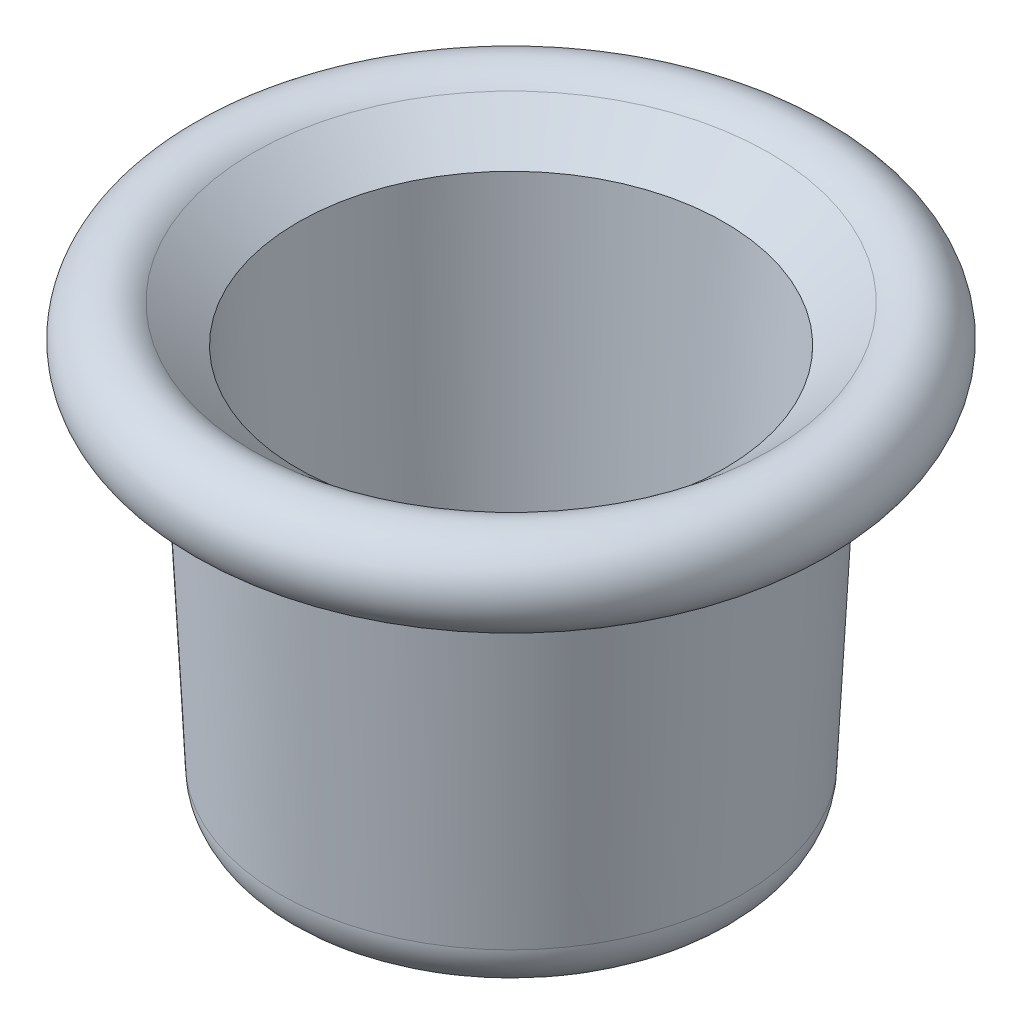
ISO-10303-21;
HEADER;
FILE_DESCRIPTION(('STEP AP214'),'2;1');
FILE_NAME('part.step','',(''),(''),'','','');
FILE_SCHEMA(('AUTOMOTIVE_DESIGN { 1 0 10303 214 1 1 1 1 }'));
ENDSEC;
DATA;
#1=APPLICATION_CONTEXT('core data for automotive mechanical design processes');
#2=APPLICATION_PROTOCOL_DEFINITION('international standard','automotive_design',2000,#1);
#3=PRODUCT_CONTEXT('',#1,'mechanical');
#4=PRODUCT('Part','Part','',(#3));
#5=PRODUCT_RELATED_PRODUCT_CATEGORY('part','',(#4));
#6=PRODUCT_DEFINITION_FORMATION('','',#4);
#7=PRODUCT_DEFINITION_CONTEXT('part definition',#1,'design');
#8=PRODUCT_DEFINITION('design','',#6,#7);
#9=PRODUCT_DEFINITION_SHAPE('','',#8);
#10=(LENGTH_UNIT() NAMED_UNIT(*) SI_UNIT(.MILLI.,.METRE.));
#11=(NAMED_UNIT(*) PLANE_ANGLE_UNIT() SI_UNIT($,.RADIAN.));
#12=(NAMED_UNIT(*) SI_UNIT($,.STERADIAN.) SOLID_ANGLE_UNIT());
#13=UNCERTAINTY_MEASURE_WITH_UNIT(LENGTH_MEASURE(1.E-05),#10,'distance_accuracy_value','');
#14=(GEOMETRIC_REPRESENTATION_CONTEXT(3) GLOBAL_UNCERTAINTY_ASSIGNED_CONTEXT((#13)) GLOBAL_UNIT_ASSIGNED_CONTEXT((#10,
#11,#12)) REPRESENTATION_CONTEXT('',''));
#15=CARTESIAN_POINT('',(0.,0.,0.));
#16=DIRECTION('',(0.,0.,1.));
#17=DIRECTION('',(1.,0.,0.));
#18=AXIS2_PLACEMENT_3D('',#15,#16,#17);
#19=CARTESIAN_POINT('',(3.,2.50000000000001,0.));
#20=DIRECTION('',(0.,-1.,0.));
#21=DIRECTION('',(1.,0.,0.));
#22=AXIS2_PLACEMENT_3D('',#19,#20,#21);
#23=PLANE('',#22);
#24=CARTESIAN_POINT('',(0.,2.50000000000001,0.));
#25=DIRECTION('',(0.,-1.,0.));
#26=DIRECTION('',(1.,0.,0.));
#27=AXIS2_PLACEMENT_3D('',#24,#25,#26);
#28=CIRCLE('',#27,4.00000000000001);
#29=CARTESIAN_POINT('',(4.,2.50000000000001,0.));
#30=VERTEX_POINT('',#29);
#31=EDGE_CURVE('E10',#30,#30,#28,.T.);
#32=ORIENTED_EDGE('',*,*,#31,.T.);
#33=EDGE_LOOP('',(#32));
#34=FACE_BOUND('',#33,.T.);
#35=CARTESIAN_POINT('',(0.,2.50000000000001,0.));
#36=DIRECTION('',(0.,-1.,0.));
#37=DIRECTION('',(1.,0.,0.));
#38=AXIS2_PLACEMENT_3D('',#35,#36,#37);
#39=CIRCLE('',#38,3.00000000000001);
#40=CARTESIAN_POINT('',(3.,2.50000000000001,0.));
#41=VERTEX_POINT('',#40);
#42=EDGE_CURVE('E48',#41,#41,#39,.T.);
#43=ORIENTED_EDGE('',*,*,#42,.F.);
#44=EDGE_LOOP('',(#43));
#45=FACE_BOUND('',#44,.T.);
#46=ADVANCED_FACE('F20',(#34,#45),#23,.T.);
#47=CARTESIAN_POINT('',(0.,2.5,0.));
#48=DIRECTION('',(0.,-1.,0.));
#49=DIRECTION('',(1.,0.,0.));
#50=AXIS2_PLACEMENT_3D('',#47,#48,#49);
#51=TOROIDAL_SURFACE('',#50,5.37500000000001,1.375);
#52=CARTESIAN_POINT('',(0.,2.5,0.));
#53=DIRECTION('',(0.,-1.,0.));
#54=DIRECTION('',(1.,0.,0.));
#55=AXIS2_PLACEMENT_3D('',#52,#53,#54);
#56=CIRCLE('',#55,6.75000000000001);
#57=CARTESIAN_POINT('',(6.75,2.5,0.));
#58=VERTEX_POINT('',#57);
#59=EDGE_CURVE('E26',#58,#58,#56,.T.);
#60=ORIENTED_EDGE('',*,*,#59,.T.);
#61=EDGE_LOOP('',(#60));
#62=FACE_BOUND('',#61,.T.);
#63=ORIENTED_EDGE('',*,*,#31,.F.);
#64=EDGE_LOOP('',(#63));
#65=FACE_BOUND('',#64,.T.);
#66=ADVANCED_FACE('F56',(#62,#65),#51,.T.);
#67=CARTESIAN_POINT('',(0.,2.5,0.));
#68=DIRECTION('',(0.,1.,0.));
#69=DIRECTION('',(-1.,0.,0.));
#70=AXIS2_PLACEMENT_3D('',#67,#68,#69);
#71=CONICAL_SURFACE('',#70,6.75000000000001,0.0492770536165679);
#72=CARTESIAN_POINT('',(0.,12.6384963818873,0.));
#73=DIRECTION('',(0.,-1.,0.));
#74=DIRECTION('',(1.,0.,0.));
#75=AXIS2_PLACEMENT_3D('',#72,#73,#74);
#76=CIRCLE('',#75,7.25000000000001);
#77=CARTESIAN_POINT('',(7.24999999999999,12.6384963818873,0.));
#78=VERTEX_POINT('',#77);
#79=EDGE_CURVE('E30',#78,#78,#76,.T.);
#80=ORIENTED_EDGE('',*,*,#79,.T.);
#81=EDGE_LOOP('',(#80));
#82=FACE_BOUND('',#81,.T.);
#83=ORIENTED_EDGE('',*,*,#59,.F.);
#84=EDGE_LOOP('',(#83));
#85=FACE_BOUND('',#84,.T.);
#86=ADVANCED_FACE('F60',(#82,#85),#71,.T.);
#87=CARTESIAN_POINT('',(0.,13.2044000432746,0.));
#88=DIRECTION('',(0.,-1.,0.));
#89=DIRECTION('',(1.,0.,0.));
#90=AXIS2_PLACEMENT_3D('',#87,#88,#89);
#91=TOROIDAL_SURFACE('',#90,8.36456406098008,1.24999999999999);
#92=CARTESIAN_POINT('',(0.,14.1614046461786,0.));
#93=DIRECTION('',(0.,-1.,0.));
#94=DIRECTION('',(1.,0.,0.));
#95=AXIS2_PLACEMENT_3D('',#92,#93,#94);
#96=CIRCLE('',#95,7.56042340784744);
#97=CARTESIAN_POINT('',(7.56042340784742,14.1614046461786,0.));
#98=VERTEX_POINT('',#97);
#99=EDGE_CURVE('E34',#98,#98,#96,.T.);
#100=ORIENTED_EDGE('',*,*,#99,.T.);
#101=EDGE_LOOP('',(#100));
#102=FACE_BOUND('',#101,.T.);
#103=ORIENTED_EDGE('',*,*,#79,.F.);
#104=EDGE_LOOP('',(#103));
#105=FACE_BOUND('',#104,.T.);
#106=ADVANCED_FACE('F64',(#102,#105),#91,.T.);
#107=CARTESIAN_POINT('',(0.,14.1614046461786,0.));
#108=DIRECTION('',(0.,1.,0.));
#109=DIRECTION('',(-1.,0.,0.));
#110=AXIS2_PLACEMENT_3D('',#107,#108,#109);
#111=CONICAL_SURFACE('',#110,7.56042340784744,0.871979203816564);
#112=CARTESIAN_POINT('',(0.,13.0567357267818,0.));
#113=DIRECTION('',(0.,-1.,0.));
#114=DIRECTION('',(1.,0.,0.));
#115=AXIS2_PLACEMENT_3D('',#112,#113,#114);
#116=CIRCLE('',#115,6.24576130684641);
#117=CARTESIAN_POINT('',(6.2457613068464,13.0567357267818,0.));
#118=VERTEX_POINT('',#117);
#119=EDGE_CURVE('E39',#118,#118,#116,.T.);
#120=ORIENTED_EDGE('',*,*,#119,.T.);
#121=EDGE_LOOP('',(#120));
#122=FACE_BOUND('',#121,.T.);
#123=ORIENTED_EDGE('',*,*,#99,.F.);
#124=EDGE_LOOP('',(#123));
#125=FACE_BOUND('',#124,.T.);
#126=ADVANCED_FACE('F71',(#122,#125),#111,.F.);
#127=CARTESIAN_POINT('',(0.,13.0567357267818,0.));
#128=DIRECTION('',(0.,1.,0.));
#129=DIRECTION('',(-1.,0.,0.));
#130=AXIS2_PLACEMENT_3D('',#127,#128,#129);
#131=CONICAL_SURFACE('',#130,6.24576130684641,0.0492770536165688);
#132=CARTESIAN_POINT('',(0.,4.49999999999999,0.));
#133=DIRECTION('',(0.,-1.,0.));
#134=DIRECTION('',(1.,0.,0.));
#135=AXIS2_PLACEMENT_3D('',#132,#133,#134);
#136=CIRCLE('',#135,5.82376896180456);
#137=CARTESIAN_POINT('',(5.82376896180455,4.49999999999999,0.));
#138=VERTEX_POINT('',#137);
#139=EDGE_CURVE('E42',#138,#138,#136,.T.);
#140=ORIENTED_EDGE('',*,*,#139,.T.);
#141=EDGE_LOOP('',(#140));
#142=FACE_BOUND('',#141,.T.);
#143=ORIENTED_EDGE('',*,*,#119,.F.);
#144=EDGE_LOOP('',(#143));
#145=FACE_BOUND('',#144,.T.);
#146=ADVANCED_FACE('F75',(#142,#145),#131,.F.);
#147=CARTESIAN_POINT('',(4.,4.50000000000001,0.));
#148=DIRECTION('',(0.,1.,0.));
#149=DIRECTION('',(-1.,0.,0.));
#150=AXIS2_PLACEMENT_3D('',#147,#148,#149);
#151=PLANE('',#150);
#152=CARTESIAN_POINT('',(0.,4.5,0.));
#153=DIRECTION('',(0.,-1.,0.));
#154=DIRECTION('',(1.,0.,0.));
#155=AXIS2_PLACEMENT_3D('',#152,#153,#154);
#156=CIRCLE('',#155,3.00000000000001);
#157=CARTESIAN_POINT('',(3.,4.50000000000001,0.));
#158=VERTEX_POINT('',#157);
#159=EDGE_CURVE('E45',#158,#158,#156,.T.);
#160=ORIENTED_EDGE('',*,*,#159,.T.);
#161=EDGE_LOOP('',(#160));
#162=FACE_BOUND('',#161,.T.);
#163=ORIENTED_EDGE('',*,*,#139,.F.);
#164=EDGE_LOOP('',(#163));
#165=FACE_BOUND('',#164,.T.);
#166=ADVANCED_FACE('F79',(#162,#165),#151,.T.);
#167=CARTESIAN_POINT('',(0.,-10.,0.));
#168=DIRECTION('',(0.,-1.,0.));
#169=DIRECTION('',(1.,0.,0.));
#170=AXIS2_PLACEMENT_3D('',#167,#168,#169);
#171=CYLINDRICAL_SURFACE('',#170,3.00000000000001);
#172=ORIENTED_EDGE('',*,*,#42,.T.);
#173=EDGE_LOOP('',(#172));
#174=FACE_BOUND('',#173,.T.);
#175=ORIENTED_EDGE('',*,*,#159,.F.);
#176=EDGE_LOOP('',(#175));
#177=FACE_BOUND('',#176,.T.);
#178=ADVANCED_FACE('F52',(#174,#177),#171,.F.);
#179=CLOSED_SHELL('',(#46,#66,#86,#106,#126,#146,#166,#178));
#180=MANIFOLD_SOLID_BREP('B2',#179);
#181=ADVANCED_BREP_SHAPE_REPRESENTATION('',(#18,#180),#14);
#182=SHAPE_DEFINITION_REPRESENTATION(#9,#181);
ENDSEC;
END-ISO-10303-21;
